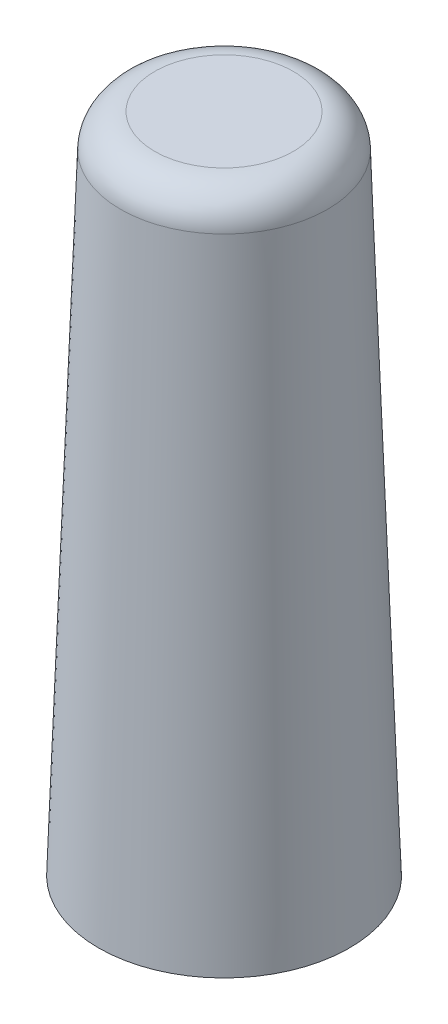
ISO-10303-21;
HEADER;
FILE_DESCRIPTION(('STEP AP214'),'2;1');
FILE_NAME('part.step','',(''),(''),'','','');
FILE_SCHEMA(('AUTOMOTIVE_DESIGN { 1 0 10303 214 1 1 1 1 }'));
ENDSEC;
DATA;
#1=APPLICATION_CONTEXT('core data for automotive mechanical design processes');
#2=APPLICATION_PROTOCOL_DEFINITION('international standard','automotive_design',2000,#1);
#3=PRODUCT_CONTEXT('',#1,'mechanical');
#4=PRODUCT('Part','Part','',(#3));
#5=PRODUCT_RELATED_PRODUCT_CATEGORY('part','',(#4));
#6=PRODUCT_DEFINITION_FORMATION('','',#4);
#7=PRODUCT_DEFINITION_CONTEXT('part definition',#1,'design');
#8=PRODUCT_DEFINITION('design','',#6,#7);
#9=PRODUCT_DEFINITION_SHAPE('','',#8);
#10=(LENGTH_UNIT() NAMED_UNIT(*) SI_UNIT(.MILLI.,.METRE.));
#11=(NAMED_UNIT(*) PLANE_ANGLE_UNIT() SI_UNIT($,.RADIAN.));
#12=(NAMED_UNIT(*) SI_UNIT($,.STERADIAN.) SOLID_ANGLE_UNIT());
#13=UNCERTAINTY_MEASURE_WITH_UNIT(LENGTH_MEASURE(1.E-05),#10,'distance_accuracy_value','');
#14=(GEOMETRIC_REPRESENTATION_CONTEXT(3) GLOBAL_UNCERTAINTY_ASSIGNED_CONTEXT((#13)) GLOBAL_UNIT_ASSIGNED_CONTEXT((#10,
#11,#12)) REPRESENTATION_CONTEXT('',''));
#15=CARTESIAN_POINT('',(0.,0.,0.));
#16=DIRECTION('',(0.,0.,1.));
#17=DIRECTION('',(1.,0.,0.));
#18=AXIS2_PLACEMENT_3D('',#15,#16,#17);
#19=CARTESIAN_POINT('',(0.,0.,0.));
#20=DIRECTION('',(0.,-1.,0.));
#21=DIRECTION('',(0.,0.,1.));
#22=AXIS2_PLACEMENT_3D('',#19,#20,#21);
#23=CONICAL_SURFACE('',#22,11.,0.0349065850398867);
#24=CARTESIAN_POINT('',(0.,55.1046984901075,0.));
#25=DIRECTION('',(0.,-1.,0.));
#26=DIRECTION('',(0.,0.,-1.));
#27=AXIS2_PLACEMENT_3D('',#24,#25,#26);
#28=CIRCLE('',#27,9.07570152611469);
#29=CARTESIAN_POINT('',(0.,55.1046984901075,-9.07570152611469));
#30=VERTEX_POINT('',#29);
#31=EDGE_CURVE('E10',#30,#30,#28,.T.);
#32=ORIENTED_EDGE('',*,*,#31,.T.);
#33=EDGE_LOOP('',(#32));
#34=FACE_BOUND('',#33,.T.);
#35=CARTESIAN_POINT('',(0.,0.,0.));
#36=DIRECTION('',(0.,1.,0.));
#37=DIRECTION('',(0.,0.,1.));
#38=AXIS2_PLACEMENT_3D('',#35,#36,#37);
#39=CIRCLE('',#38,11.);
#40=CARTESIAN_POINT('',(0.,0.,11.));
#41=VERTEX_POINT('',#40);
#42=EDGE_CURVE('E41',#41,#41,#39,.T.);
#43=ORIENTED_EDGE('',*,*,#42,.T.);
#44=EDGE_LOOP('',(#43));
#45=FACE_BOUND('',#44,.T.);
#46=ADVANCED_FACE('F30',(#34,#45),#23,.T.);
#47=CARTESIAN_POINT('',(0.,58.,0.));
#48=DIRECTION('',(0.,1.,0.));
#49=DIRECTION('',(0.,0.,1.));
#50=AXIS2_PLACEMENT_3D('',#47,#48,#49);
#51=PLANE('',#50);
#52=CARTESIAN_POINT('',(0.,58.,0.));
#53=DIRECTION('',(0.,1.,0.));
#54=DIRECTION('',(0.,0.,1.));
#55=AXIS2_PLACEMENT_3D('',#52,#53,#54);
#56=CIRCLE('',#55,6.07752904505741);
#57=CARTESIAN_POINT('',(0.,58.,6.07752904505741));
#58=VERTEX_POINT('',#57);
#59=EDGE_CURVE('E37',#58,#58,#56,.T.);
#60=ORIENTED_EDGE('',*,*,#59,.T.);
#61=EDGE_LOOP('',(#60));
#62=FACE_BOUND('',#61,.T.);
#63=ADVANCED_FACE('F51',(#62),#51,.T.);
#64=CARTESIAN_POINT('',(0.,0.,0.));
#65=DIRECTION('',(0.,1.,0.));
#66=DIRECTION('',(0.,0.,1.));
#67=AXIS2_PLACEMENT_3D('',#64,#65,#66);
#68=PLANE('',#67);
#69=ORIENTED_EDGE('',*,*,#42,.F.);
#70=EDGE_LOOP('',(#69));
#71=FACE_BOUND('',#70,.T.);
#72=ADVANCED_FACE('F49',(#71),#68,.F.);
#73=CARTESIAN_POINT('',(0.,55.,0.));
#74=DIRECTION('',(0.,1.,0.));
#75=DIRECTION('',(0.,0.,1.));
#76=AXIS2_PLACEMENT_3D('',#73,#74,#75);
#77=TOROIDAL_SURFACE('',#76,6.07752904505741,3.);
#78=ORIENTED_EDGE('',*,*,#31,.F.);
#79=EDGE_LOOP('',(#78));
#80=FACE_BOUND('',#79,.T.);
#81=ORIENTED_EDGE('',*,*,#59,.F.);
#82=EDGE_LOOP('',(#81));
#83=FACE_BOUND('',#82,.T.);
#84=ADVANCED_FACE('F32',(#80,#83),#77,.T.);
#85=CLOSED_SHELL('',(#46,#63,#72,#84));
#86=MANIFOLD_SOLID_BREP('B2',#85);
#87=ADVANCED_BREP_SHAPE_REPRESENTATION('',(#18,#86),#14);
#88=SHAPE_DEFINITION_REPRESENTATION(#9,#87);
ENDSEC;
END-ISO-10303-21;
